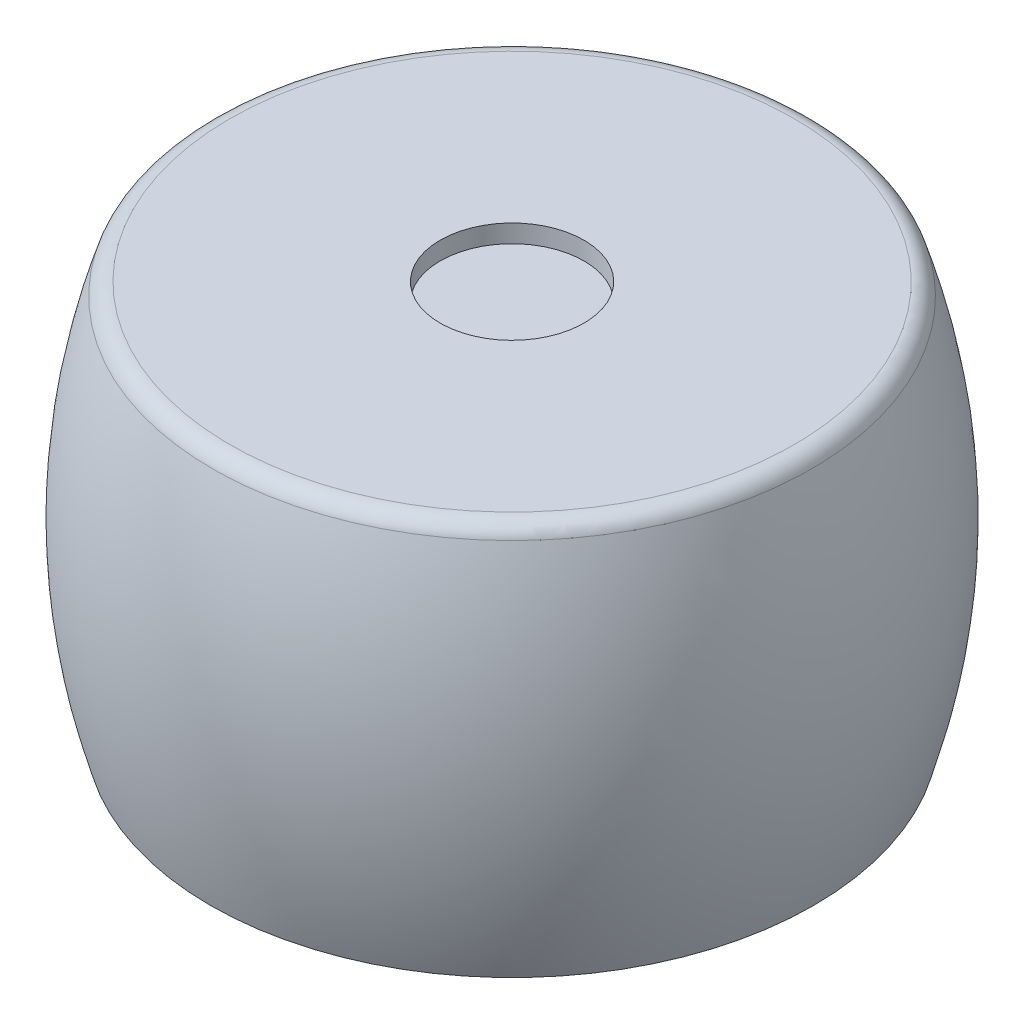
ISO-10303-21;
HEADER;
FILE_DESCRIPTION(('STEP AP214'),'2;1');
FILE_NAME('part.step','',(''),(''),'','','');
FILE_SCHEMA(('AUTOMOTIVE_DESIGN { 1 0 10303 214 1 1 1 1 }'));
ENDSEC;
DATA;
#1=APPLICATION_CONTEXT('core data for automotive mechanical design processes');
#2=APPLICATION_PROTOCOL_DEFINITION('international standard','automotive_design',2000,#1);
#3=PRODUCT_CONTEXT('',#1,'mechanical');
#4=PRODUCT('Part','Part','',(#3));
#5=PRODUCT_RELATED_PRODUCT_CATEGORY('part','',(#4));
#6=PRODUCT_DEFINITION_FORMATION('','',#4);
#7=PRODUCT_DEFINITION_CONTEXT('part definition',#1,'design');
#8=PRODUCT_DEFINITION('design','',#6,#7);
#9=PRODUCT_DEFINITION_SHAPE('','',#8);
#10=(LENGTH_UNIT() NAMED_UNIT(*) SI_UNIT(.MILLI.,.METRE.));
#11=(NAMED_UNIT(*) PLANE_ANGLE_UNIT() SI_UNIT($,.RADIAN.));
#12=(NAMED_UNIT(*) SI_UNIT($,.STERADIAN.) SOLID_ANGLE_UNIT());
#13=UNCERTAINTY_MEASURE_WITH_UNIT(LENGTH_MEASURE(1.E-05),#10,'distance_accuracy_value','');
#14=(GEOMETRIC_REPRESENTATION_CONTEXT(3) GLOBAL_UNCERTAINTY_ASSIGNED_CONTEXT((#13)) GLOBAL_UNIT_ASSIGNED_CONTEXT((#10,
#11,#12)) REPRESENTATION_CONTEXT('',''));
#15=CARTESIAN_POINT('',(0.,0.,0.));
#16=DIRECTION('',(0.,0.,1.));
#17=DIRECTION('',(1.,0.,0.));
#18=AXIS2_PLACEMENT_3D('',#15,#16,#17);
#19=CARTESIAN_POINT('',(0.,-1.50000000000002,0.));
#20=DIRECTION('',(0.,1.,0.));
#21=DIRECTION('',(-1.,0.,0.));
#22=AXIS2_PLACEMENT_3D('',#19,#20,#21);
#23=CYLINDRICAL_SURFACE('',#22,30.);
#24=CARTESIAN_POINT('',(0.,1.49999999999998,0.));
#25=DIRECTION('',(0.,-1.,0.));
#26=DIRECTION('',(1.,0.,0.));
#27=AXIS2_PLACEMENT_3D('',#24,#25,#26);
#28=CIRCLE('',#27,30.);
#29=CARTESIAN_POINT('',(30.,1.49999999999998,0.));
#30=VERTEX_POINT('',#29);
#31=EDGE_CURVE('E11',#30,#30,#28,.F.);
#32=ORIENTED_EDGE('',*,*,#31,.T.);
#33=EDGE_LOOP('',(#32));
#34=FACE_BOUND('',#33,.T.);
#35=CARTESIAN_POINT('',(0.,17.5,0.));
#36=DIRECTION('',(0.,-1.,0.));
#37=DIRECTION('',(1.,0.,0.));
#38=AXIS2_PLACEMENT_3D('',#35,#36,#37);
#39=CIRCLE('',#38,30.);
#40=CARTESIAN_POINT('',(30.,17.5,0.));
#41=VERTEX_POINT('',#40);
#42=EDGE_CURVE('E61',#41,#41,#39,.T.);
#43=ORIENTED_EDGE('',*,*,#42,.T.);
#44=EDGE_LOOP('',(#43));
#45=FACE_BOUND('',#44,.T.);
#46=ADVANCED_FACE('F50',(#34,#45),#23,.T.);
#47=CARTESIAN_POINT('',(0.,-1.50000000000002,0.));
#48=DIRECTION('',(0.,-1.,0.));
#49=DIRECTION('',(1.,0.,0.));
#50=AXIS2_PLACEMENT_3D('',#47,#48,#49);
#51=PLANE('',#50);
#52=CARTESIAN_POINT('',(0.,-1.50000000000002,0.));
#53=DIRECTION('',(0.,-1.,0.));
#54=DIRECTION('',(1.,0.,0.));
#55=AXIS2_PLACEMENT_3D('',#52,#53,#54);
#56=CIRCLE('',#55,27.);
#57=CARTESIAN_POINT('',(27.,-1.50000000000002,0.));
#58=VERTEX_POINT('',#57);
#59=EDGE_CURVE('E57',#58,#58,#56,.T.);
#60=ORIENTED_EDGE('',*,*,#59,.T.);
#61=EDGE_LOOP('',(#60));
#62=FACE_BOUND('',#61,.T.);
#63=ADVANCED_FACE('F71',(#62),#51,.T.);
#64=CARTESIAN_POINT('',(0.,17.5,0.));
#65=DIRECTION('',(0.,-1.,0.));
#66=DIRECTION('',(1.,0.,0.));
#67=AXIS2_PLACEMENT_3D('',#64,#65,#66);
#68=PLANE('',#67);
#69=ORIENTED_EDGE('',*,*,#42,.F.);
#70=EDGE_LOOP('',(#69));
#71=FACE_BOUND('',#70,.T.);
#72=ADVANCED_FACE('F69',(#71),#68,.F.);
#73=CARTESIAN_POINT('',(0.,1.49999999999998,0.));
#74=DIRECTION('',(0.,-1.,0.));
#75=DIRECTION('',(1.,0.,0.));
#76=AXIS2_PLACEMENT_3D('',#73,#74,#75);
#77=TOROIDAL_SURFACE('',#76,27.,3.);
#78=ORIENTED_EDGE('',*,*,#31,.F.);
#79=EDGE_LOOP('',(#78));
#80=FACE_BOUND('',#79,.T.);
#81=ORIENTED_EDGE('',*,*,#59,.F.);
#82=EDGE_LOOP('',(#81));
#83=FACE_BOUND('',#82,.T.);
#84=ADVANCED_FACE('F52',(#80,#83),#77,.T.);
#85=CLOSED_SHELL('',(#46,#63,#72,#84));
#86=MANIFOLD_SOLID_BREP('B2',#85);
#87=CARTESIAN_POINT('',(0.,17.5,0.));
#88=DIRECTION('',(0.,1.,0.));
#89=DIRECTION('',(-1.,0.,0.));
#90=AXIS2_PLACEMENT_3D('',#87,#88,#89);
#91=CYLINDRICAL_SURFACE('',#90,30.);
#92=CARTESIAN_POINT('',(0.,17.5,0.));
#93=DIRECTION('',(0.,-1.,0.));
#94=DIRECTION('',(1.,0.,0.));
#95=AXIS2_PLACEMENT_3D('',#92,#93,#94);
#96=CIRCLE('',#95,30.);
#97=CARTESIAN_POINT('',(30.,17.5,0.));
#98=VERTEX_POINT('',#97);
#99=EDGE_CURVE('E49',#98,#98,#96,.T.);
#100=ORIENTED_EDGE('',*,*,#99,.F.);
#101=EDGE_LOOP('',(#100));
#102=FACE_BOUND('',#101,.T.);
#103=CARTESIAN_POINT('',(0.,29.5,0.));
#104=DIRECTION('',(0.,-1.,0.));
#105=DIRECTION('',(1.,0.,0.));
#106=AXIS2_PLACEMENT_3D('',#103,#104,#105);
#107=CIRCLE('',#106,30.);
#108=CARTESIAN_POINT('',(30.,29.5,0.));
#109=VERTEX_POINT('',#108);
#110=EDGE_CURVE('E124',#109,#109,#107,.T.);
#111=ORIENTED_EDGE('',*,*,#110,.T.);
#112=EDGE_LOOP('',(#111));
#113=FACE_BOUND('',#112,.T.);
#114=ADVANCED_FACE('F121',(#102,#113),#91,.T.);
#115=CARTESIAN_POINT('',(0.,17.5,0.));
#116=DIRECTION('',(0.,-1.,0.));
#117=DIRECTION('',(1.,0.,0.));
#118=AXIS2_PLACEMENT_3D('',#115,#116,#117);
#119=PLANE('',#118);
#120=ORIENTED_EDGE('',*,*,#99,.T.);
#121=EDGE_LOOP('',(#120));
#122=FACE_BOUND('',#121,.T.);
#123=ADVANCED_FACE('F136',(#122),#119,.T.);
#124=CARTESIAN_POINT('',(0.,29.5,0.));
#125=DIRECTION('',(0.,-1.,0.));
#126=DIRECTION('',(1.,0.,0.));
#127=AXIS2_PLACEMENT_3D('',#124,#125,#126);
#128=PLANE('',#127);
#129=ORIENTED_EDGE('',*,*,#110,.F.);
#130=EDGE_LOOP('',(#129));
#131=FACE_BOUND('',#130,.T.);
#132=ADVANCED_FACE('F134',(#131),#128,.F.);
#133=CLOSED_SHELL('',(#114,#123,#132));
#134=MANIFOLD_SOLID_BREP('B6',#133);
#135=CARTESIAN_POINT('',(-49.2874763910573,32.5,0.));
#136=CARTESIAN_POINT('',(-60.1779396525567,0.165343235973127,0.));
#137=CARTESIAN_POINT('',(-50.3513658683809,-32.5,0.));
#138=CARTESIAN_POINT('',(-50.2213761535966,-32.9321097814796,0.));
#139=CARTESIAN_POINT('',(-50.0913864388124,-33.3642195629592,0.));
#140=B_SPLINE_CURVE_WITH_KNOTS('',2,(#135,#136,#137,#138,#139),.UNSPECIFIED.,.F.,.F.,(3,2,3),
(0.,1.,1.01322838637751),.UNSPECIFIED.);
#141=CARTESIAN_POINT('',(0.,32.5,0.));
#142=DIRECTION('',(0.,1.,0.));
#143=AXIS1_PLACEMENT('',#141,#142);
#144=SURFACE_OF_REVOLUTION('',#140,#143);
#145=CARTESIAN_POINT('',(0.,30.4037730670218,0.));
#146=DIRECTION('',(0.,1.,0.));
#147=DIRECTION('',(-1.,0.,0.));
#148=AXIS2_PLACEMENT_3D('',#145,#146,#147);
#149=CIRCLE('',#148,49.9716181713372);
#150=CARTESIAN_POINT('',(-49.9716181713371,30.4037730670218,0.));
#151=VERTEX_POINT('',#150);
#152=EDGE_CURVE('E120',#151,#151,#149,.F.);
#153=ORIENTED_EDGE('',*,*,#152,.T.);
#154=EDGE_LOOP('',(#153));
#155=FACE_BOUND('',#154,.T.);
#156=CARTESIAN_POINT('',(0.,-32.5,0.));
#157=DIRECTION('',(0.,1.,0.));
#158=DIRECTION('',(-1.,0.,0.));
#159=AXIS2_PLACEMENT_3D('',#156,#157,#158);
#160=CIRCLE('',#159,50.3513658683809);
#161=CARTESIAN_POINT('',(-50.3513658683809,-32.5,0.));
#162=VERTEX_POINT('',#161);
#163=EDGE_CURVE('E182',#162,#162,#160,.T.);
#164=ORIENTED_EDGE('',*,*,#163,.T.);
#165=EDGE_LOOP('',(#164));
#166=FACE_BOUND('',#165,.T.);
#167=ADVANCED_FACE('F168',(#155,#166),#144,.F.);
#168=CARTESIAN_POINT('',(0.,32.5,0.));
#169=DIRECTION('',(0.,1.,0.));
#170=DIRECTION('',(-1.,0.,0.));
#171=AXIS2_PLACEMENT_3D('',#168,#169,#170);
#172=PLANE('',#171);
#173=CARTESIAN_POINT('',(0.,32.5,0.));
#174=DIRECTION('',(0.,1.,0.));
#175=DIRECTION('',(-1.,0.,0.));
#176=AXIS2_PLACEMENT_3D('',#173,#174,#175);
#177=CIRCLE('',#176,12.);
#178=CARTESIAN_POINT('',(-12.,32.5,0.));
#179=VERTEX_POINT('',#178);
#180=EDGE_CURVE('E221',#179,#179,#177,.T.);
#181=ORIENTED_EDGE('',*,*,#180,.F.);
#182=EDGE_LOOP('',(#181));
#183=FACE_BOUND('',#182,.T.);
#184=CARTESIAN_POINT('',(0.,32.5,0.));
#185=DIRECTION('',(0.,1.,0.));
#186=DIRECTION('',(-1.,0.,0.));
#187=AXIS2_PLACEMENT_3D('',#184,#185,#186);
#188=CIRCLE('',#187,47.1109898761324);
#189=CARTESIAN_POINT('',(-47.1109898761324,32.5,0.));
#190=VERTEX_POINT('',#189);
#191=EDGE_CURVE('E177',#190,#190,#188,.T.);
#192=ORIENTED_EDGE('',*,*,#191,.T.);
#193=EDGE_LOOP('',(#192));
#194=FACE_BOUND('',#193,.T.);
#195=ADVANCED_FACE('F203',(#183,#194),#172,.T.);
#196=CARTESIAN_POINT('',(0.,-32.5,0.));
#197=DIRECTION('',(0.,-1.,0.));
#198=DIRECTION('',(1.,0.,0.));
#199=AXIS2_PLACEMENT_3D('',#196,#197,#198);
#200=PLANE('',#199);
#201=CARTESIAN_POINT('',(0.,-32.5,0.));
#202=DIRECTION('',(0.,1.,0.));
#203=DIRECTION('',(-1.,0.,0.));
#204=AXIS2_PLACEMENT_3D('',#201,#202,#203);
#205=CIRCLE('',#204,47.2185612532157);
#206=CARTESIAN_POINT('',(-47.2185612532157,-32.5,0.));
#207=VERTEX_POINT('',#206);
#208=EDGE_CURVE('E193',#207,#207,#205,.T.);
#209=ORIENTED_EDGE('',*,*,#208,.T.);
#210=EDGE_LOOP('',(#209));
#211=FACE_BOUND('',#210,.T.);
#212=ORIENTED_EDGE('',*,*,#163,.F.);
#213=EDGE_LOOP('',(#212));
#214=FACE_BOUND('',#213,.T.);
#215=ADVANCED_FACE('F211',(#211,#214),#200,.T.);
#216=CARTESIAN_POINT('',(0.,29.5,0.));
#217=DIRECTION('',(0.,1.,0.));
#218=DIRECTION('',(-1.,0.,0.));
#219=AXIS2_PLACEMENT_3D('',#216,#217,#218);
#220=TOROIDAL_SURFACE('',#219,47.1109898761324,3.);
#221=ORIENTED_EDGE('',*,*,#152,.F.);
#222=EDGE_LOOP('',(#221));
#223=FACE_BOUND('',#222,.T.);
#224=ORIENTED_EDGE('',*,*,#191,.F.);
#225=EDGE_LOOP('',(#224));
#226=FACE_BOUND('',#225,.T.);
#227=ADVANCED_FACE('F170',(#223,#226),#220,.T.);
#228=CARTESIAN_POINT('',(-49.2874763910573,32.5,0.));
#229=CARTESIAN_POINT('',(-60.1779396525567,0.165343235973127,0.));
#230=CARTESIAN_POINT('',(-50.2213761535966,-32.9321097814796,0.));
#231=CARTESIAN_POINT('',(-50.0913864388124,-33.3642195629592,0.));
#232=B_SPLINE_CURVE_WITH_KNOTS('',2,(#228,#229,#230,#231),.UNSPECIFIED.,.F.,.F.,(3,1,3),(0.,1.,
1.01322838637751),.UNSPECIFIED.);
#233=CARTESIAN_POINT('',(0.,32.5,0.));
#234=DIRECTION('',(0.,1.,0.));
#235=AXIS1_PLACEMENT('',#233,#234);
#236=SURFACE_OF_REVOLUTION('',#232,#235);
#237=OFFSET_SURFACE('',#236,3.,.F.);
#238=CARTESIAN_POINT('',(0.,29.5,0.));
#239=DIRECTION('',(0.,1.,0.));
#240=DIRECTION('',(-1.,0.,0.));
#241=AXIS2_PLACEMENT_3D('',#238,#239,#240);
#242=CIRCLE('',#241,47.1109898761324);
#243=CARTESIAN_POINT('',(-47.1109898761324,29.5,0.));
#244=VERTEX_POINT('',#243);
#245=EDGE_CURVE('E188',#244,#244,#242,.T.);
#246=ORIENTED_EDGE('',*,*,#245,.T.);
#247=EDGE_LOOP('',(#246));
#248=FACE_BOUND('',#247,.T.);
#249=ORIENTED_EDGE('',*,*,#208,.F.);
#250=EDGE_LOOP('',(#249));
#251=FACE_BOUND('',#250,.T.);
#252=ADVANCED_FACE('F204',(#248,#251),#237,.T.);
#253=CARTESIAN_POINT('',(0.,29.5,0.));
#254=DIRECTION('',(0.,1.,0.));
#255=DIRECTION('',(-1.,0.,0.));
#256=AXIS2_PLACEMENT_3D('',#253,#254,#255);
#257=PLANE('',#256);
#258=CARTESIAN_POINT('',(0.,29.5,0.));
#259=DIRECTION('',(0.,1.,0.));
#260=DIRECTION('',(-1.,0.,0.));
#261=AXIS2_PLACEMENT_3D('',#258,#259,#260);
#262=CIRCLE('',#261,12.);
#263=CARTESIAN_POINT('',(-12.,29.5,0.));
#264=VERTEX_POINT('',#263);
#265=EDGE_CURVE('E172',#264,#264,#262,.T.);
#266=ORIENTED_EDGE('',*,*,#265,.T.);
#267=EDGE_LOOP('',(#266));
#268=FACE_BOUND('',#267,.T.);
#269=ORIENTED_EDGE('',*,*,#245,.F.);
#270=EDGE_LOOP('',(#269));
#271=FACE_BOUND('',#270,.T.);
#272=ADVANCED_FACE('F206',(#268,#271),#257,.F.);
#273=CARTESIAN_POINT('',(0.,22.5,0.));
#274=DIRECTION('',(0.,1.,0.));
#275=DIRECTION('',(-1.,0.,0.));
#276=AXIS2_PLACEMENT_3D('',#273,#274,#275);
#277=CYLINDRICAL_SURFACE('',#276,12.);
#278=ORIENTED_EDGE('',*,*,#180,.T.);
#279=EDGE_LOOP('',(#278));
#280=FACE_BOUND('',#279,.T.);
#281=ORIENTED_EDGE('',*,*,#265,.F.);
#282=EDGE_LOOP('',(#281));
#283=FACE_BOUND('',#282,.T.);
#284=ADVANCED_FACE('F209',(#280,#283),#277,.F.);
#285=CLOSED_SHELL('',(#167,#195,#215,#227,#252,#272,#284));
#286=MANIFOLD_SOLID_BREP('B44',#285);
#287=ADVANCED_BREP_SHAPE_REPRESENTATION('',(#18,#86,#134,#286),#14);
#288=SHAPE_DEFINITION_REPRESENTATION(#9,#287);
ENDSEC;
END-ISO-10303-21;
